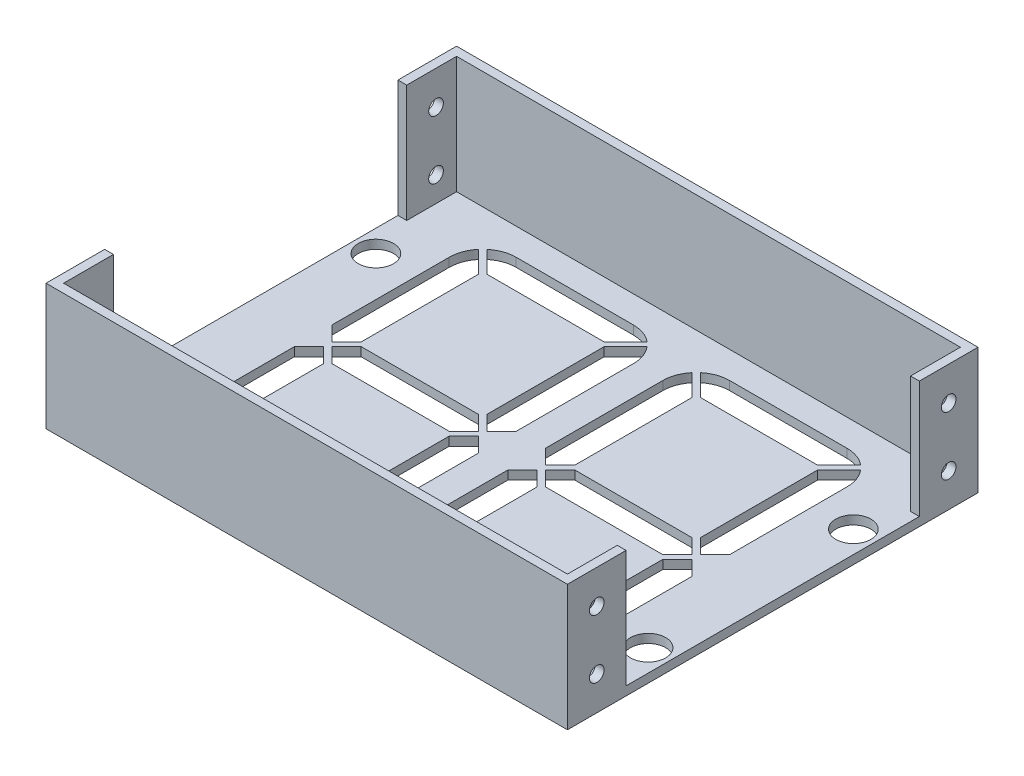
from build123d import *

# Parameters (mm, degrees)
CROQUIS1_R              = 6
SALIENTE_EXTRUIR1_DEPTH = 3
SALIENTE_EXTRUIR2_DEPTH = 40
CROQUIS3_R              = 2.5
CORTAR_EXTRUIR1_DEPTH   = 3
CORTAR_EXTRUIR2_START   = -3
CROQUIS4_R              = 2.5
CORTAR_EXTRUIR2_DEPTH   = 3


with BuildPart() as part:
    # Croquis1 → Saliente-Extruir1 (new body)
    with BuildSketch(Plane(origin=(0, 0, 0), x_dir=(1, 0, 0), z_dir=(0, 1, 0))):
        Polygon((-88.916915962, -0.003459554), (-88.916915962, -70.013842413), (82.826915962, -70.013842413), (88.916915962, -70.013842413), (88.916915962, 70.006917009), (-36.409998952, 70.006917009), (-88.916915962, 70.006917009), align=None)
        with Locations(Location((-81.416915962, -35.003459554, 0), (0, 0, 270))):
            Circle(CROQUIS1_R, mode=Mode.SUBTRACT)
        with Locations(Location((-81.416915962, 34.996540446, 0), (0, 0, 270))):
            Circle(CROQUIS1_R, mode=Mode.SUBTRACT)
        with Locations(Location((81.416915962, 34.996540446, 0), (0, 0, 270))):
            Circle(CROQUIS1_R, mode=Mode.SUBTRACT)
        with Locations(Location((81.416915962, -35.003459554, 0), (0, 0, 270))):
            Circle(CROQUIS1_R, mode=Mode.SUBTRACT)
        with BuildLine():
            Line((-11.409998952, 52.826915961), (-9.077197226, 55.159717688))
            ThreePointArc((-9.077197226, 55.159717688), (-12.508591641, 57.139410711), (-16.41, 57.826917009))
            Line((-16.41, 57.826917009), (-56.409997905, 57.826917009))
            ThreePointArc((-56.409997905, 57.826917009), (-60.311577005, 57.139570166), (-63.743372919, 55.160292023))
            Line((-63.743372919, 55.160292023), (-61.409997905, 52.826917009))
            Line((-61.409997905, 52.826917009), (-56.409997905, 47.826917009))
            Line((-56.409997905, 47.826917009), (-16.409997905, 47.826917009))
            Line((-16.409997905, 47.826917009), (-11.409998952, 52.826915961))
        make_face(mode=Mode.SUBTRACT)
        Polygon((-16.413457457, -5.003459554), (-56.413457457, -5.003459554), (-61.413457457, -0.003459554), (-56.413457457, 4.996540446), (-16.413457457, 4.996540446), (-11.413457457, -0.003459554), align=None, mode=Mode.SUBTRACT)
        with BuildLine():
            Line((-9.99578539, 51.412702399), (-7.663050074, 53.745437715))
            ThreePointArc((-7.663050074, 53.745437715), (-5.683862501, 50.31436108), (-4.996539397, 46.413456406))
            Line((-4.996539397, 46.413456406), (-4.996539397, 6.413458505))
            Line((-4.996539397, 6.413458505), (-9.999243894, 1.410754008))
            Line((-9.999243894, 1.410754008), (-14.998488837, 6.409998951))
            Line((-14.998488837, 6.409998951), (-14.998488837, 46.409998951))
            Line((-14.998488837, 46.409998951), (-9.99578539, 51.412702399))
        make_face(mode=Mode.SUBTRACT)
        with BuildLine():
            Line((-62.827671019, 1.410754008), (-57.828426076, 6.409998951))
            Line((-57.828426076, 6.409998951), (-57.828426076, 46.409998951))
            Line((-57.828426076, 46.409998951), (-62.827671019, 51.409243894))
            Line((-62.827671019, 51.409243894), (-65.160979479, 53.742552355))
            ThreePointArc((-65.160979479, 53.742552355), (-67.13975227, 50.31107434), (-67.826915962, 46.409998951))
            Line((-67.826915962, 46.409998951), (-67.826915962, 6.409998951))
            Line((-67.826915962, 6.409998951), (-62.827671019, 1.410754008))
        make_face(mode=Mode.SUBTRACT)
        with BuildLine():
            Line((-67.826915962, -6.416918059), (-62.827671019, -1.417673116))
            Line((-62.827671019, -1.417673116), (-57.828426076, -6.416918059))
            Line((-57.828426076, -6.416918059), (-57.828426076, -46.416918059))
            Line((-57.828426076, -46.416918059), (-62.827671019, -51.416163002))
            Line((-62.827671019, -51.416163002), (-65.160980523, -53.749472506))
            ThreePointArc((-65.160980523, -53.749472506), (-67.13975256, -50.31799376), (-67.826915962, -46.416918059))
            Line((-67.826915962, -46.416918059), (-67.826915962, -6.416918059))
        make_face(mode=Mode.SUBTRACT)
        with BuildLine():
            Line((-9.995779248, -1.414212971), (-14.998488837, -6.416918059))
            Line((-14.998488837, -6.416918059), (-14.998488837, -46.416918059))
            Line((-14.998488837, -46.416918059), (-9.999243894, -51.416163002))
            Line((-9.999243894, -51.416163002), (-7.665397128, -53.753243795))
            ThreePointArc((-7.665397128, -53.753243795), (-5.687031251, -50.323347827), (-4.999996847, -46.423847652))
            Line((-4.999996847, -46.423847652), (-4.999996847, -6.416918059))
            Line((-4.999996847, -6.416918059), (-9.995779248, -1.414212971))
        make_face(mode=Mode.SUBTRACT)
        with BuildLine():
            Line((-63.743367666, -55.167218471), (-61.409991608, -52.833842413))
            Line((-61.409991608, -52.833842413), (-56.409991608, -47.833842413))
            Line((-56.409991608, -47.833842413), (-16.409991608, -47.833842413))
            Line((-16.409991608, -47.833842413), (-11.406529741, -52.830380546))
            Line((-11.406529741, -52.830380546), (-9.075756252, -55.164383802))
            ThreePointArc((-9.075756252, -55.164383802), (-12.507523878, -57.145728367), (-16.409991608, -57.833842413))
            Line((-16.409991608, -57.833842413), (-56.409991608, -57.833842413))
            ThreePointArc((-56.409991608, -57.833842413), (-60.311571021, -57.14649586), (-63.743367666, -55.167218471))
        make_face(mode=Mode.SUBTRACT)
        with BuildLine():
            Line((11.406529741, -52.830380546), (9.075756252, -55.164383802))
            ThreePointArc((9.075756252, -55.164383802), (12.507523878, -57.145728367), (16.409991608, -57.833842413))
            Line((16.409991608, -57.833842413), (56.409991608, -57.833842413))
            ThreePointArc((56.409991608, -57.833842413), (60.311571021, -57.14649586), (63.743367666, -55.167218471))
            Line((63.743367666, -55.167218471), (61.409991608, -52.833842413))
            Line((61.409991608, -52.833842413), (56.409991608, -47.833842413))
            Line((56.409991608, -47.833842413), (16.409991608, -47.833842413))
            Line((16.409991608, -47.833842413), (11.406529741, -52.830380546))
        make_face(mode=Mode.SUBTRACT)
        with BuildLine():
            Line((7.665397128, -53.753243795), (9.999243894, -51.416163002))
            Line((9.999243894, -51.416163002), (14.998488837, -46.416918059))
            Line((14.998488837, -46.416918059), (14.998488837, -6.416918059))
            Line((14.998488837, -6.416918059), (9.995779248, -1.414212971))
            Line((9.995779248, -1.414212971), (4.999996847, -6.416918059))
            Line((4.999996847, -6.416918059), (4.999996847, -46.423847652))
            ThreePointArc((4.999996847, -46.423847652), (5.687031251, -50.323347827), (7.665397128, -53.753243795))
        make_face(mode=Mode.SUBTRACT)
        with BuildLine():
            Line((57.828426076, -46.416918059), (62.827671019, -51.416163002))
            Line((62.827671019, -51.416163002), (65.160980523, -53.749472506))
            ThreePointArc((65.160980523, -53.749472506), (67.13975256, -50.31799376), (67.826915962, -46.416918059))
            Line((67.826915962, -46.416918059), (67.826915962, -6.416918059))
            Line((67.826915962, -6.416918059), (62.827671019, -1.417673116))
            Line((62.827671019, -1.417673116), (57.828426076, -6.416918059))
            Line((57.828426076, -6.416918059), (57.828426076, -46.416918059))
        make_face(mode=Mode.SUBTRACT)
        with BuildLine():
            Line((16.41, 57.826917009), (56.409997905, 57.826917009))
            ThreePointArc((56.409997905, 57.826917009), (60.311577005, 57.139570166), (63.743372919, 55.160292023))
            Line((63.743372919, 55.160292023), (61.409997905, 52.826917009))
            Line((61.409997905, 52.826917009), (56.409997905, 47.826917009))
            Line((56.409997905, 47.826917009), (16.409997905, 47.826917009))
            Line((16.409997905, 47.826917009), (11.409998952, 52.826915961))
            Line((11.409998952, 52.826915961), (9.077197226, 55.159717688))
            ThreePointArc((9.077197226, 55.159717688), (12.508591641, 57.139410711), (16.41, 57.826917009))
        make_face(mode=Mode.SUBTRACT)
        with BuildLine():
            Line((62.827671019, 51.409243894), (65.160979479, 53.742552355))
            ThreePointArc((65.160979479, 53.742552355), (67.13975227, 50.31107434), (67.826915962, 46.409998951))
            Line((67.826915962, 46.409998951), (67.826915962, 6.409998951))
            Line((67.826915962, 6.409998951), (62.827671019, 1.410754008))
            Line((62.827671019, 1.410754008), (57.828426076, 6.409998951))
            Line((57.828426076, 6.409998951), (57.828426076, 46.409998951))
            Line((57.828426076, 46.409998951), (62.827671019, 51.409243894))
        make_face(mode=Mode.SUBTRACT)
        with BuildLine():
            Line((4.996539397, 6.413458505), (9.999243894, 1.410754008))
            Line((9.999243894, 1.410754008), (14.998488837, 6.409998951))
            Line((14.998488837, 6.409998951), (14.998488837, 46.409998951))
            Line((14.998488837, 46.409998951), (9.99578539, 51.412702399))
            Line((9.99578539, 51.412702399), (7.663050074, 53.745437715))
            ThreePointArc((7.663050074, 53.745437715), (5.683862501, 50.31436108), (4.996539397, 46.413456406))
            Line((4.996539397, 46.413456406), (4.996539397, 6.413458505))
        make_face(mode=Mode.SUBTRACT)
        Polygon((11.413457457, -0.003459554), (16.413457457, 4.996540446), (56.413457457, 4.996540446), (61.413457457, -0.003459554), (56.413457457, -5.003459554), (16.413457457, -5.003459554), align=None, mode=Mode.SUBTRACT)
    extrude(amount=SALIENTE_EXTRUIR1_DEPTH)

    # Croquis2 → Saliente-Extruir2 (add)
    with BuildSketch(Plane(origin=(0, 3, 0), x_dir=(1, 0, 0), z_dir=(0, 1, 0))):
        Polygon((-85.916915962, 67.006917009), (85.916915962, 67.006917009), (85.916915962, 50.006917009), (88.916915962, 50.006917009), (88.916915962, 70.006917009), (-88.916915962, 70.006917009), (-88.916915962, 50.006917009), (-85.916915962, 50.006917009), align=None)
        Polygon((-85.916915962, -67.013842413), (85.916915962, -67.013842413), (85.916915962, -50.013842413), (88.916915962, -50.013842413), (88.916915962, -70.013842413), (-88.916915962, -70.013842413), (-88.916915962, -50.013842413), (-85.916915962, -50.013842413), align=None)
    extrude(amount=SALIENTE_EXTRUIR2_DEPTH)

    # Croquis3 → Cortar-Extruir1 (cut)
    with BuildSketch(Plane(origin=(88.916915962, 0, 0), x_dir=(0, 0, -1), z_dir=(1, 0, 0))):
        with Locations((-60.013842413, 31.5)):
            Circle(CROQUIS3_R)
        with Locations((-60.013842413, 11.5)):
            Circle(CROQUIS3_R)
        with Locations((60.006917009, 31.5)):
            Circle(CROQUIS3_R)
        with Locations((60.006917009, 11.5)):
            Circle(CROQUIS3_R)
    extrude(amount=-CORTAR_EXTRUIR1_DEPTH, mode=Mode.SUBTRACT)

    # Croquis4 → Cortar-Extruir2 (cut)
    with BuildSketch(Plane.ZY.offset(88.916915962).offset(CORTAR_EXTRUIR2_START)):
        with Locations(Location((-60.006917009, 11.5, 0), (0, 0, 180))):
            Circle(CROQUIS4_R)
        with Locations(Location((-60.006917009, 31.5, 0), (0, 0, 180))):
            Circle(CROQUIS4_R)
        with Locations(Location((60.013842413, 31.5, 0), (0, 0, 180))):
            Circle(CROQUIS4_R)
        with Locations(Location((60.013842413, 11.5, 0), (0, 0, 180))):
            Circle(CROQUIS4_R)
    extrude(amount=CORTAR_EXTRUIR2_DEPTH, mode=Mode.SUBTRACT)


solid = part.part
